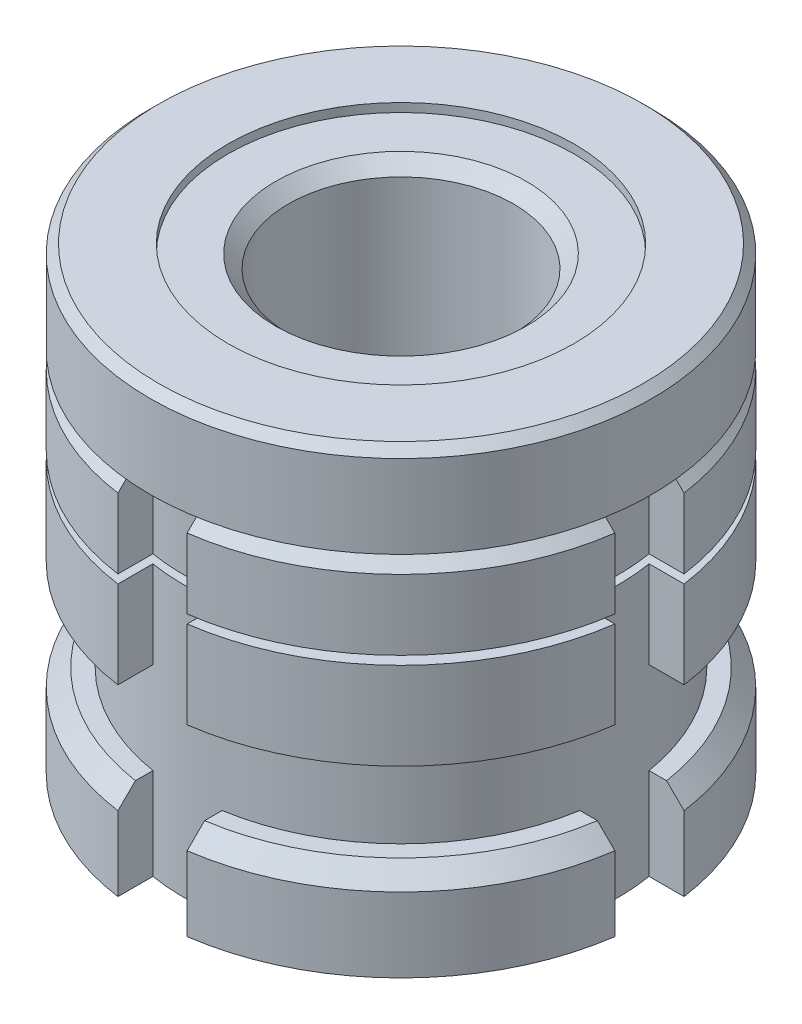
from build123d import *
from build123d.topology import SkipClean

# Parameters (mm, degrees)
SKETCH1_R           = 29
BOSS_EXTRUDE1_DEPTH = 21.2
SKETCH2_W           = 9
SKETCH2_H           = 1
SKETCH3_R           = 25
BOSS_EXTRUDE2_DEPTH = 21.2
SKETCH4_R           = 29
BOSS_EXTRUDE3_DEPTH = 10.6
CUT_EXTRUDE4_START  = -42.4
CUT_EXTRUDE4_DEPTH  = 42.4
CHAMFER1_SIZE       = 2
SKETCH6_R           = 29
BOSS_EXTRUDE4_DEPTH = 10.6
CHAMFER2_SIZE       = 1
CUT_EXTRUDE5_START  = -1
SKETCH7_R           = 20
CUT_EXTRUDE5_DEPTH  = 1
SKETCH8_R           = 13
CUT_EXTRUDE6_DEPTH  = 52
CHAMFER3_SIZE       = 1.5


with BuildPart() as part:
    # Sketch1 → Boss-Extrude1 (new body)
    with BuildSketch(Plane(origin=(0, 0, 0), x_dir=(1, 0, 0), z_dir=(0, 1, 0))):
        with Locations(Location((0, 0, 0), (0, 0, 270))):
            Circle(SKETCH1_R)
    extrude(amount=BOSS_EXTRUDE1_DEPTH)

    # Sketch2 → Cut-Revolve1 (revolve, cut)
    with BuildSketch(Plane(origin=(0, 0, 0), x_dir=(0, 0, -1), z_dir=(1, 0, 0))):
        with Locations((-24.5, 10.6)):
            Rectangle(SKETCH2_W, SKETCH2_H)
    revolve(axis=Axis((0, 13.26477, 0), (0, -1, 0)), mode=Mode.SUBTRACT)

    # Sketch3 → Boss-Extrude2 (add)
    with BuildSketch(Plane.XZ):
        with Locations(Location((0, 0, 0), (0, 0, 270))):
            Circle(SKETCH3_R)
    extrude(amount=BOSS_EXTRUDE2_DEPTH)

    # Sketch4 → Boss-Extrude3 (add)
    with BuildSketch(Plane.XZ.offset(21.2)):
        with Locations(Location((0, 0, 0), (0, 0, 90))):
            Circle(SKETCH4_R)
    extrude(amount=-BOSS_EXTRUDE3_DEPTH)

    # Sketch5 → Cut-Extrude4 (cut)
    with SkipClean():  # the faces are left unmerged after this step: merging them gives an invalid solid
        with BuildSketch(Plane(origin=(0, 21.2, 0), x_dir=(1, 0, 0), z_dir=(0, 1, 0)).offset(CUT_EXTRUDE4_START)):
            with BuildLine():
                Line((-28.722813, 4), (-24.677925, 4))
                ThreePointArc((-24.677925, 4), (-25, 0), (-24.677925, -4))
                Line((-24.677925, -4), (-28.722813, -4))
                ThreePointArc((-28.722813, -4), (-29, 0), (-28.722813, 4))
            make_face()
            with BuildLine():
                Line((-4, 28.722813), (-4, 24.677925))
                ThreePointArc((-4, 24.677925), (0, 25), (4, 24.677925))
                Line((4, 24.677925), (4, 28.722813))
                ThreePointArc((4, 28.722813), (0, 29), (-4, 28.722813))
            make_face()
            with BuildLine():
                Line((24.677925, 4), (28.722813, 4))
                ThreePointArc((28.722813, 4), (29, 0), (28.722813, -4))
                Line((28.722813, -4), (24.677925, -4))
                ThreePointArc((24.677925, -4), (25, 0), (24.677925, 4))
            make_face()
            with BuildLine():
                Line((-4, -24.677925), (-4, -28.722813))
                ThreePointArc((-4, -28.722813), (0, -29), (4, -28.722813))
                Line((4, -28.722813), (4, -24.677925))
                ThreePointArc((4, -24.677925), (0, -25), (-4, -24.677925))
            make_face()
        extrude(amount=CUT_EXTRUDE4_DEPTH, mode=Mode.SUBTRACT)

    # Chamfer1
    chamfer1_edges = [part.edges().sort_by_distance(p)[0] for p in [
        (20.506097, -10.6, -20.506097),
        (20.506097, -10.6, 20.506097),
        (-20.506097, -10.6, 20.506097),
        (-20.506097, -10.6, -20.506097),
        (20.506097, 21.2, 20.506097),
        (20.506097, 21.2, -20.506097),
        (-20.506097, 21.2, -20.506097),
        (-20.506097, 21.2, 20.506097),
    ]]
    chamfer(chamfer1_edges, length=CHAMFER1_SIZE)

    # Sketch6 → Boss-Extrude4 (add)
    with BuildSketch(Plane(origin=(0, 21.2, 0), x_dir=(1, 0, 0), z_dir=(0, 1, 0))):
        with Locations(Location((0, 0, 0), (0, 0, 270))):
            Circle(SKETCH6_R)
    extrude(amount=BOSS_EXTRUDE4_DEPTH)

    # Chamfer2
    chamfer2_edges = [part.edges().sort_by_distance(p)[0] for p in [
        (0, 31.8, -29),
    ]]
    chamfer(chamfer2_edges, length=CHAMFER2_SIZE)

    # Sketch7 → Cut-Extrude5 (cut)
    with BuildSketch(Plane(origin=(0, 31.8, 0), x_dir=(1, 0, 0), z_dir=(0, 1, 0)).offset(CUT_EXTRUDE5_START)):
        with Locations(Location((0, 0, 0), (0, 0, 270))):
            Circle(SKETCH7_R)
    extrude(amount=CUT_EXTRUDE5_DEPTH, mode=Mode.SUBTRACT)

    # Sketch8 → Cut-Extrude6 (cut)
    with BuildSketch(Plane(origin=(0, 30.8, 0), x_dir=(1, 0, 0), z_dir=(0, 1, 0))):
        with Locations(Location((0, 0, 0), (0, 0, 270))):
            Circle(SKETCH8_R)
    extrude(amount=-CUT_EXTRUDE6_DEPTH, mode=Mode.SUBTRACT)

    # Chamfer3
    chamfer3_edges = [part.edges().sort_by_distance(p)[0] for p in [
        (0, 30.8, -13),
        (0, -21.2, -13),
    ]]
    chamfer(chamfer3_edges, length=CHAMFER3_SIZE)


solid = part.part
